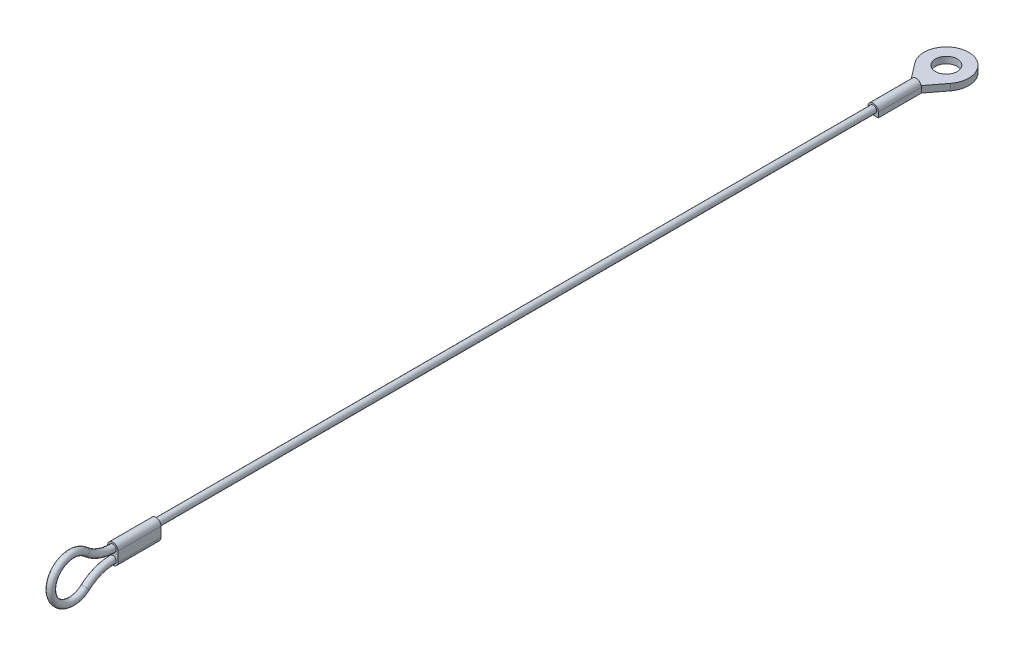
from build123d import *

# Parameters (mm, degrees)
SKETCH2_R           = 0.795
BOSS_EXTRUDE1_DEPTH = 10
BOSS_EXTRUDE2_DEPTH = 10
SKETCH5_R           = 2.54
BOSS_EXTRUDE3_DEPTH = 1.52


with BuildPart() as part:
    # Sweep1: sweep along a path in Sketch1
    with BuildLine(Plane(origin=(0, 0, 0), x_dir=(0, 0, -1), z_dir=(1, 0, 0))) as sweep1_path:
        Line((0, 0), (-176.6, 0))
        ThreePointArc((-176.6, 0), (-180.025492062, 0.631945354), (-183, 2.444582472))
        ThreePointArc((-183, 2.444582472), (-191, -1.133126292), (-183, -4.710835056))
        ThreePointArc((-183, -4.710835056), (-180.025492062, -2.898197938), (-176.6, -2.266252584))
    # Sketch2 → Sweep1 (sweep)
    with BuildSketch(Plane.XY):
        Circle(SKETCH2_R)
    sweep(path=sweep1_path.line)

    # Sketch3 → Boss-Extrude1 (add)
    with BuildSketch(Plane(origin=(0, 0, 176.6), x_dir=(-1, 0, 0), z_dir=(0, 0, -1))):
        with BuildLine():
            Line((1.195, 0), (1.195, -2.266252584))
            ThreePointArc((1.195, -2.266252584), (0, -3.461252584), (-1.195, -2.266252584))
            Line((-1.195, -2.266252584), (-1.195, 0))
            ThreePointArc((-1.195, 0), (0, 1.195), (1.195, 0))
        make_face()
    extrude(amount=BOSS_EXTRUDE1_DEPTH)

    # Sketch4 → Boss-Extrude2 (add)
    with BuildSketch(Plane(origin=(0, 0, 0), x_dir=(-1, 0, 0), z_dir=(0, 0, -1))):
        with BuildLine():
            Line((-1.195, 0), (-1.195, -1.195))
            Line((-1.195, -1.195), (0, -1.195))
            Line((0, -1.195), (1.195, -1.195))
            Line((1.195, -1.195), (1.195, 0))
            ThreePointArc((1.195, 0), (0, 1.195), (-1.195, 0))
        make_face()
    extrude(amount=BOSS_EXTRUDE2_DEPTH)

    # Sketch5 → Boss-Extrude3 (add)
    with BuildSketch(Plane.XZ.offset(1.195)):
        with BuildLine():
            Line((-1.195, -10), (1.195, -10))
            Line((1.195, -10), (4.132281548, -13.835150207))
            ThreePointArc((4.132281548, -13.835150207), (0, -22.205), (-4.132281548, -13.835150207))
            Line((-4.132281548, -13.835150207), (-1.195, -10))
        make_face()
        with Locations(Location((0, -17, 0), (0, 0, 270))):
            Circle(SKETCH5_R, mode=Mode.SUBTRACT)
    extrude(amount=-BOSS_EXTRUDE3_DEPTH)


solid = part.part
